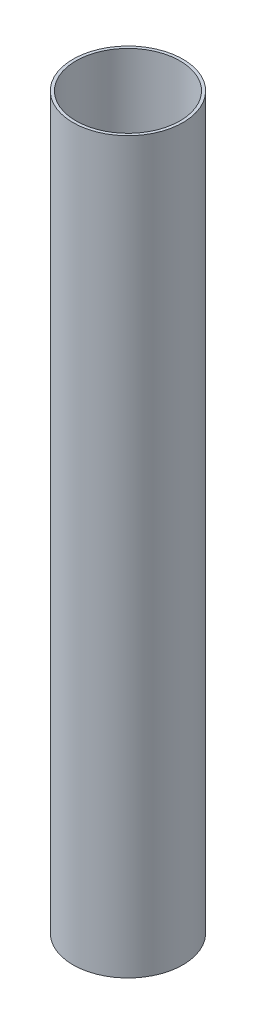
ISO-10303-21;
HEADER;
FILE_DESCRIPTION(('STEP AP214'),'2;1');
FILE_NAME('part.step','',(''),(''),'','','');
FILE_SCHEMA(('AUTOMOTIVE_DESIGN { 1 0 10303 214 1 1 1 1 }'));
ENDSEC;
DATA;
#1=APPLICATION_CONTEXT('core data for automotive mechanical design processes');
#2=APPLICATION_PROTOCOL_DEFINITION('international standard','automotive_design',2000,#1);
#3=PRODUCT_CONTEXT('',#1,'mechanical');
#4=PRODUCT('Part','Part','',(#3));
#5=PRODUCT_RELATED_PRODUCT_CATEGORY('part','',(#4));
#6=PRODUCT_DEFINITION_FORMATION('','',#4);
#7=PRODUCT_DEFINITION_CONTEXT('part definition',#1,'design');
#8=PRODUCT_DEFINITION('design','',#6,#7);
#9=PRODUCT_DEFINITION_SHAPE('','',#8);
#10=(LENGTH_UNIT() NAMED_UNIT(*) SI_UNIT(.MILLI.,.METRE.));
#11=(NAMED_UNIT(*) PLANE_ANGLE_UNIT() SI_UNIT($,.RADIAN.));
#12=(NAMED_UNIT(*) SI_UNIT($,.STERADIAN.) SOLID_ANGLE_UNIT());
#13=UNCERTAINTY_MEASURE_WITH_UNIT(LENGTH_MEASURE(1.E-05),#10,'distance_accuracy_value','');
#14=(GEOMETRIC_REPRESENTATION_CONTEXT(3) GLOBAL_UNCERTAINTY_ASSIGNED_CONTEXT((#13)) GLOBAL_UNIT_ASSIGNED_CONTEXT((#10,
#11,#12)) REPRESENTATION_CONTEXT('',''));
#15=CARTESIAN_POINT('',(0.,0.,0.));
#16=DIRECTION('',(0.,0.,1.));
#17=DIRECTION('',(1.,0.,0.));
#18=AXIS2_PLACEMENT_3D('',#15,#16,#17);
#19=CARTESIAN_POINT('',(0.,381.,0.));
#20=DIRECTION('',(0.,1.,0.));
#21=DIRECTION('',(0.,0.,1.));
#22=AXIS2_PLACEMENT_3D('',#19,#20,#21);
#23=PLANE('',#22);
#24=CARTESIAN_POINT('',(0.,381.,0.));
#25=DIRECTION('',(0.,1.,0.));
#26=DIRECTION('',(0.,0.,1.));
#27=AXIS2_PLACEMENT_3D('',#24,#25,#26);
#28=CIRCLE('',#27,28.702);
#29=CARTESIAN_POINT('',(0.,381.,28.702));
#30=VERTEX_POINT('',#29);
#31=EDGE_CURVE('E11',#30,#30,#28,.T.);
#32=ORIENTED_EDGE('',*,*,#31,.T.);
#33=EDGE_LOOP('',(#32));
#34=FACE_BOUND('',#33,.T.);
#35=CARTESIAN_POINT('',(0.,381.,0.));
#36=DIRECTION('',(0.,1.,0.));
#37=DIRECTION('',(1.,0.,0.));
#38=AXIS2_PLACEMENT_3D('',#35,#36,#37);
#39=CIRCLE('',#38,27.178);
#40=CARTESIAN_POINT('',(27.178,381.,0.));
#41=VERTEX_POINT('',#40);
#42=EDGE_CURVE('E50',#41,#41,#39,.T.);
#43=ORIENTED_EDGE('',*,*,#42,.F.);
#44=EDGE_LOOP('',(#43));
#45=FACE_BOUND('',#44,.T.);
#46=ADVANCED_FACE('F39',(#34,#45),#23,.T.);
#47=CARTESIAN_POINT('',(0.,0.,0.));
#48=DIRECTION('',(0.,1.,0.));
#49=DIRECTION('',(0.,0.,1.));
#50=AXIS2_PLACEMENT_3D('',#47,#48,#49);
#51=PLANE('',#50);
#52=CARTESIAN_POINT('',(0.,0.,0.));
#53=DIRECTION('',(0.,1.,0.));
#54=DIRECTION('',(0.,0.,1.));
#55=AXIS2_PLACEMENT_3D('',#52,#53,#54);
#56=CIRCLE('',#55,28.702);
#57=CARTESIAN_POINT('',(0.,0.,28.702));
#58=VERTEX_POINT('',#57);
#59=EDGE_CURVE('E43',#58,#58,#56,.T.);
#60=ORIENTED_EDGE('',*,*,#59,.F.);
#61=EDGE_LOOP('',(#60));
#62=FACE_BOUND('',#61,.T.);
#63=CARTESIAN_POINT('',(0.,0.,0.));
#64=DIRECTION('',(0.,1.,0.));
#65=DIRECTION('',(1.,0.,0.));
#66=AXIS2_PLACEMENT_3D('',#63,#64,#65);
#67=CIRCLE('',#66,27.178);
#68=CARTESIAN_POINT('',(27.178,0.,0.));
#69=VERTEX_POINT('',#68);
#70=EDGE_CURVE('E52',#69,#69,#67,.T.);
#71=ORIENTED_EDGE('',*,*,#70,.T.);
#72=EDGE_LOOP('',(#71));
#73=FACE_BOUND('',#72,.T.);
#74=ADVANCED_FACE('F62',(#62,#73),#51,.F.);
#75=CARTESIAN_POINT('',(0.,381.,0.));
#76=DIRECTION('',(0.,-1.,0.));
#77=DIRECTION('',(0.,0.,-1.));
#78=AXIS2_PLACEMENT_3D('',#75,#76,#77);
#79=CYLINDRICAL_SURFACE('',#78,28.702);
#80=ORIENTED_EDGE('',*,*,#31,.F.);
#81=EDGE_LOOP('',(#80));
#82=FACE_BOUND('',#81,.T.);
#83=ORIENTED_EDGE('',*,*,#59,.T.);
#84=EDGE_LOOP('',(#83));
#85=FACE_BOUND('',#84,.T.);
#86=ADVANCED_FACE('F41',(#82,#85),#79,.T.);
#87=CARTESIAN_POINT('',(0.,381.,0.));
#88=DIRECTION('',(0.,-1.,0.));
#89=DIRECTION('',(0.,0.,-1.));
#90=AXIS2_PLACEMENT_3D('',#87,#88,#89);
#91=CYLINDRICAL_SURFACE('',#90,27.178);
#92=ORIENTED_EDGE('',*,*,#42,.T.);
#93=EDGE_LOOP('',(#92));
#94=FACE_BOUND('',#93,.T.);
#95=ORIENTED_EDGE('',*,*,#70,.F.);
#96=EDGE_LOOP('',(#95));
#97=FACE_BOUND('',#96,.T.);
#98=ADVANCED_FACE('F58',(#94,#97),#91,.F.);
#99=CLOSED_SHELL('',(#46,#74,#86,#98));
#100=MANIFOLD_SOLID_BREP('B2',#99);
#101=ADVANCED_BREP_SHAPE_REPRESENTATION('',(#18,#100),#14);
#102=SHAPE_DEFINITION_REPRESENTATION(#9,#101);
ENDSEC;
END-ISO-10303-21;
